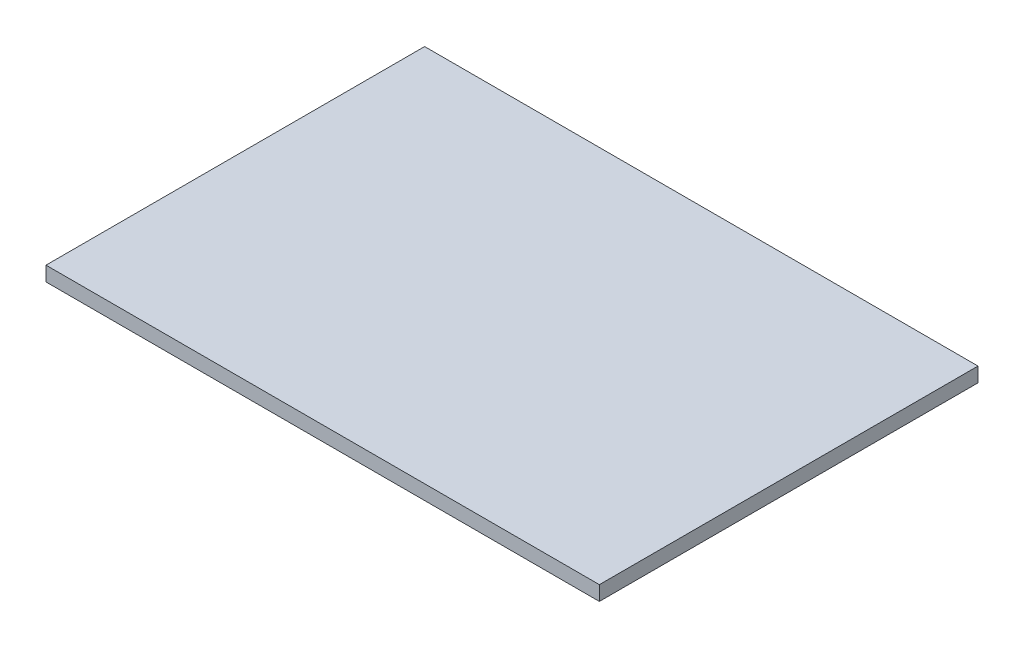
from build123d import *

# Parameters (mm, degrees)
SKETCH_1_W      = 190
SKETCH_1_H      = 130
EXTRUDE_1_DEPTH = 5


with BuildPart() as part:
    # Sketch 1 → Extrude 1 (new body)
    with BuildSketch(Plane(origin=(0, 0, 0), x_dir=(1, 0, 0), z_dir=(0, 1, 0))):
        Rectangle(SKETCH_1_W, SKETCH_1_H)
    extrude(amount=EXTRUDE_1_DEPTH)


solid = part.part
